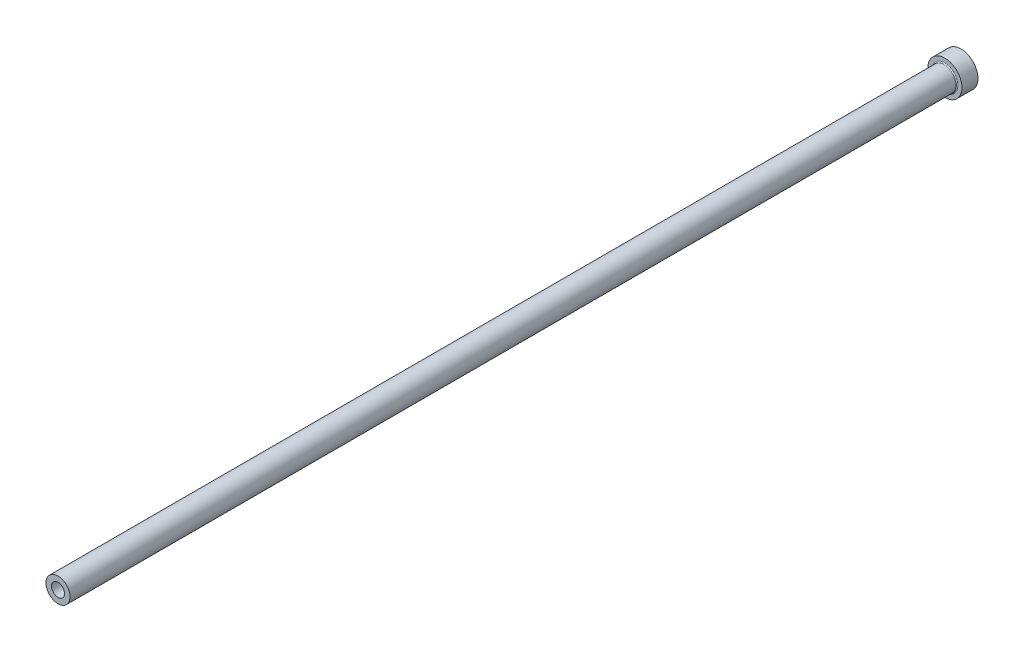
from build123d import *

# Parameters (mm, degrees)
HEAD_FILLET_R          = 0.5
ID_RELIEF_CHAMFER_SIZE = 0.5


with BuildPart() as part:
    # OD FV → Base Revolve (revolve)
    with BuildSketch(Plane(origin=(0, 0, 0), x_dir=(1, 0, 0), z_dir=(0, 1, 0))):
        Polygon((0, -450), (6, -450), (6, -8), (8.5, -8), (8.5, 0), (0, 0), align=None)
    revolve(axis=Axis((0, 0, 450), (0, 0, -1)))

    # ID FV → Hole (revolve, cut)
    with BuildSketch(Plane(origin=(0, 0, 0), x_dir=(1, 0, 0), z_dir=(0, 1, 0))):
        Polygon((0, -450), (3.25, -450), (3.25, -300), (3.5, -299.566987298), (3.5, 0), (0, 0), align=None)
    revolve(axis=Axis((0, 0, 450), (0, 0, -1)), mode=Mode.SUBTRACT)

    # Head Fillet
    head_fillet_edges = [part.edges().sort_by_distance(p)[0] for p in [
        (-6, 0, 8),
    ]]
    fillet(head_fillet_edges, radius=HEAD_FILLET_R)

    # ID Relief Chamfer
    id_relief_chamfer_edges = [part.edges().sort_by_distance(p)[0] for p in [
        (-3.5, 0, 0),
    ]]
    chamfer(id_relief_chamfer_edges, length=ID_RELIEF_CHAMFER_SIZE)


solid = part.part
